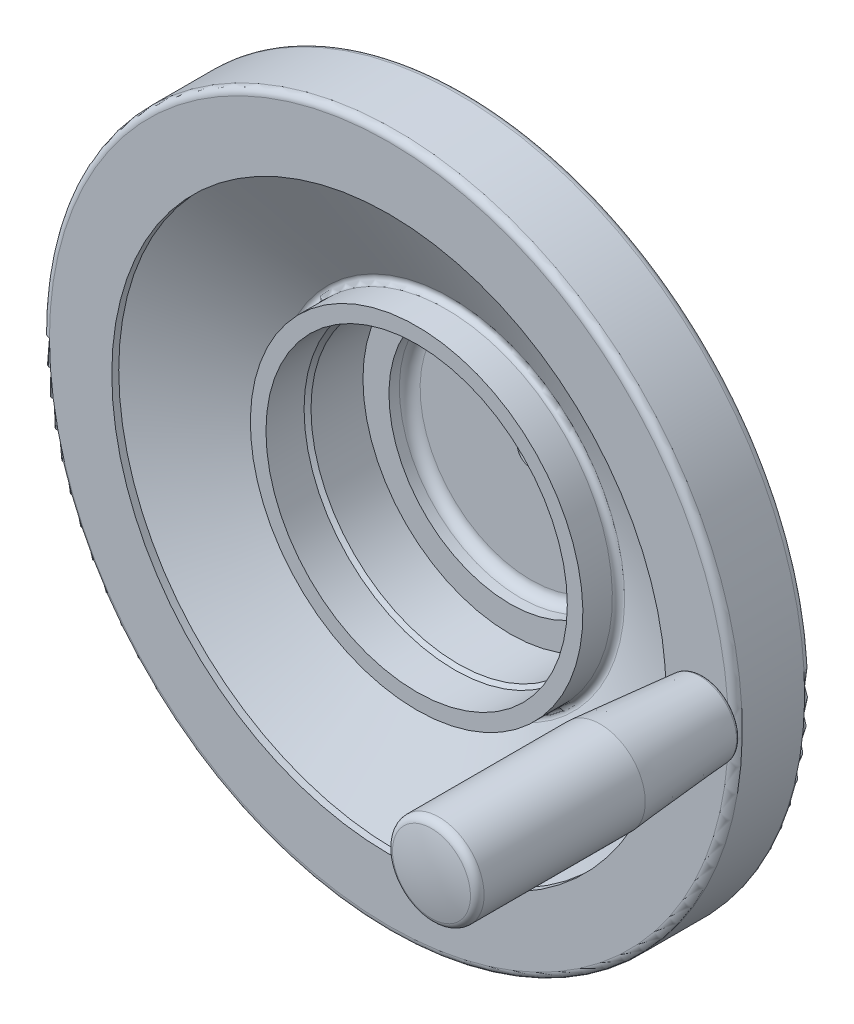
ISO-10303-21;
HEADER;
FILE_DESCRIPTION(('STEP AP214'),'2;1');
FILE_NAME('part.step','',(''),(''),'','','');
FILE_SCHEMA(('AUTOMOTIVE_DESIGN { 1 0 10303 214 1 1 1 1 }'));
ENDSEC;
DATA;
#1=APPLICATION_CONTEXT('core data for automotive mechanical design processes');
#2=APPLICATION_PROTOCOL_DEFINITION('international standard','automotive_design',2000,#1);
#3=PRODUCT_CONTEXT('',#1,'mechanical');
#4=PRODUCT('Part','Part','',(#3));
#5=PRODUCT_RELATED_PRODUCT_CATEGORY('part','',(#4));
#6=PRODUCT_DEFINITION_FORMATION('','',#4);
#7=PRODUCT_DEFINITION_CONTEXT('part definition',#1,'design');
#8=PRODUCT_DEFINITION('design','',#6,#7);
#9=PRODUCT_DEFINITION_SHAPE('','',#8);
#10=(LENGTH_UNIT() NAMED_UNIT(*) SI_UNIT(.MILLI.,.METRE.));
#11=(NAMED_UNIT(*) PLANE_ANGLE_UNIT() SI_UNIT($,.RADIAN.));
#12=(NAMED_UNIT(*) SI_UNIT($,.STERADIAN.) SOLID_ANGLE_UNIT());
#13=UNCERTAINTY_MEASURE_WITH_UNIT(LENGTH_MEASURE(1.E-05),#10,'distance_accuracy_value','');
#14=(GEOMETRIC_REPRESENTATION_CONTEXT(3) GLOBAL_UNCERTAINTY_ASSIGNED_CONTEXT((#13)) GLOBAL_UNIT_ASSIGNED_CONTEXT((#10,
#11,#12)) REPRESENTATION_CONTEXT('',''));
#15=CARTESIAN_POINT('',(0.,0.,0.));
#16=DIRECTION('',(0.,0.,1.));
#17=DIRECTION('',(1.,0.,0.));
#18=AXIS2_PLACEMENT_3D('',#15,#16,#17);
#19=CARTESIAN_POINT('',(-48.,0.,67.));
#20=DIRECTION('',(0.,0.,-1.));
#21=DIRECTION('',(0.,1.,0.));
#22=AXIS2_PLACEMENT_3D('',#19,#20,#21);
#23=PLANE('',#22);
#24=CARTESIAN_POINT('',(0.,0.,67.));
#25=DIRECTION('',(0.,0.,1.));
#26=DIRECTION('',(0.,-1.,0.));
#27=AXIS2_PLACEMENT_3D('',#24,#25,#26);
#28=CIRCLE('',#27,48.);
#29=CARTESIAN_POINT('',(0.,-48.,67.));
#30=VERTEX_POINT('',#29);
#31=EDGE_CURVE('E170',#30,#30,#28,.T.);
#32=ORIENTED_EDGE('',*,*,#31,.T.);
#33=EDGE_LOOP('',(#32));
#34=FACE_BOUND('',#33,.T.);
#35=CARTESIAN_POINT('',(0.,0.,67.));
#36=DIRECTION('',(0.,0.,-1.));
#37=DIRECTION('',(0.,1.,0.));
#38=AXIS2_PLACEMENT_3D('',#35,#36,#37);
#39=CIRCLE('',#38,43.5);
#40=CARTESIAN_POINT('',(0.,43.5,67.));
#41=VERTEX_POINT('',#40);
#42=EDGE_CURVE('E18',#41,#41,#39,.F.);
#43=ORIENTED_EDGE('',*,*,#42,.F.);
#44=EDGE_LOOP('',(#43));
#45=FACE_BOUND('',#44,.T.);
#46=ADVANCED_FACE('F14',(#34,#45),#23,.F.);
#47=CARTESIAN_POINT('',(0.,0.,30.));
#48=DIRECTION('',(0.,0.,-1.));
#49=DIRECTION('',(0.,1.,0.));
#50=AXIS2_PLACEMENT_3D('',#47,#48,#49);
#51=CYLINDRICAL_SURFACE('',#50,4.);
#52=CARTESIAN_POINT('',(0.,0.,0.));
#53=DIRECTION('',(0.,0.,-1.));
#54=DIRECTION('',(0.,1.,0.));
#55=AXIS2_PLACEMENT_3D('',#52,#53,#54);
#56=CIRCLE('',#55,4.);
#57=CARTESIAN_POINT('',(0.,4.,0.));
#58=VERTEX_POINT('',#57);
#59=EDGE_CURVE('E194',#58,#58,#56,.T.);
#60=ORIENTED_EDGE('',*,*,#59,.T.);
#61=EDGE_LOOP('',(#60));
#62=FACE_BOUND('',#61,.T.);
#63=CARTESIAN_POINT('',(0.,0.,34.));
#64=DIRECTION('',(0.,0.,1.));
#65=DIRECTION('',(0.,-1.,0.));
#66=AXIS2_PLACEMENT_3D('',#63,#64,#65);
#67=CIRCLE('',#66,4.);
#68=CARTESIAN_POINT('',(0.,-4.,34.));
#69=VERTEX_POINT('',#68);
#70=EDGE_CURVE('E53',#69,#69,#67,.F.);
#71=ORIENTED_EDGE('',*,*,#70,.F.);
#72=EDGE_LOOP('',(#71));
#73=FACE_BOUND('',#72,.T.);
#74=ADVANCED_FACE('F92',(#62,#73),#51,.F.);
#75=CARTESIAN_POINT('',(0.,0.,55.));
#76=DIRECTION('',(0.,0.,1.));
#77=DIRECTION('',(0.,-1.,0.));
#78=AXIS2_PLACEMENT_3D('',#75,#76,#77);
#79=TOROIDAL_SURFACE('',#78,98.,2.);
#80=CARTESIAN_POINT('',(0.,0.,53.));
#81=DIRECTION('',(0.,0.,1.));
#82=DIRECTION('',(0.,-1.,0.));
#83=AXIS2_PLACEMENT_3D('',#80,#81,#82);
#84=CIRCLE('',#83,98.);
#85=CARTESIAN_POINT('',(0.,-98.,53.));
#86=VERTEX_POINT('',#85);
#87=EDGE_CURVE('E22',#86,#86,#84,.T.);
#88=ORIENTED_EDGE('',*,*,#87,.T.);
#89=EDGE_LOOP('',(#88));
#90=FACE_BOUND('',#89,.T.);
#91=CARTESIAN_POINT('',(0.,0.,55.));
#92=DIRECTION('',(0.,0.,1.));
#93=DIRECTION('',(0.,-1.,0.));
#94=AXIS2_PLACEMENT_3D('',#91,#92,#93);
#95=CIRCLE('',#94,100.);
#96=CARTESIAN_POINT('',(0.,-100.,55.));
#97=VERTEX_POINT('',#96);
#98=EDGE_CURVE('E191',#97,#97,#95,.T.);
#99=ORIENTED_EDGE('',*,*,#98,.F.);
#100=EDGE_LOOP('',(#99));
#101=FACE_BOUND('',#100,.T.);
#102=ADVANCED_FACE('F16',(#90,#101),#79,.T.);
#103=CARTESIAN_POINT('',(-98.,0.,53.));
#104=DIRECTION('',(0.,0.,-1.));
#105=DIRECTION('',(0.,1.,0.));
#106=AXIS2_PLACEMENT_3D('',#103,#104,#105);
#107=PLANE('',#106);
#108=CARTESIAN_POINT('',(0.,0.,53.));
#109=DIRECTION('',(0.,0.,1.));
#110=DIRECTION('',(0.,-1.,0.));
#111=AXIS2_PLACEMENT_3D('',#108,#109,#110);
#112=CIRCLE('',#111,57.0227272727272);
#113=CARTESIAN_POINT('',(0.,-57.0227272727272,53.));
#114=VERTEX_POINT('',#113);
#115=EDGE_CURVE('E37',#114,#114,#112,.T.);
#116=ORIENTED_EDGE('',*,*,#115,.T.);
#117=EDGE_LOOP('',(#116));
#118=FACE_BOUND('',#117,.T.);
#119=ORIENTED_EDGE('',*,*,#87,.F.);
#120=EDGE_LOOP('',(#119));
#121=FACE_BOUND('',#120,.T.);
#122=ADVANCED_FACE('F475',(#118,#121),#107,.T.);
#123=CARTESIAN_POINT('',(0.,0.,53.));
#124=DIRECTION('',(0.,0.,1.));
#125=DIRECTION('',(0.,-1.,0.));
#126=AXIS2_PLACEMENT_3D('',#123,#124,#125);
#127=CONICAL_SURFACE('',#126,57.0227272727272,1.04023843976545);
#128=CARTESIAN_POINT('',(0.,0.,48.));
#129=DIRECTION('',(0.,0.,1.));
#130=DIRECTION('',(0.,-1.,0.));
#131=AXIS2_PLACEMENT_3D('',#128,#129,#130);
#132=CIRCLE('',#131,48.5);
#133=CARTESIAN_POINT('',(-48.5000000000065,0.,48.));
#134=VERTEX_POINT('',#133);
#135=EDGE_CURVE('E33',#134,#134,#132,.T.);
#136=ORIENTED_EDGE('',*,*,#135,.T.);
#137=EDGE_LOOP('',(#136));
#138=FACE_BOUND('',#137,.T.);
#139=ORIENTED_EDGE('',*,*,#115,.F.);
#140=EDGE_LOOP('',(#139));
#141=FACE_BOUND('',#140,.T.);
#142=ADVANCED_FACE('F35',(#138,#141),#127,.T.);
#143=CARTESIAN_POINT('',(0.,0.,48.));
#144=DIRECTION('',(0.,0.,1.));
#145=DIRECTION('',(0.,-1.,0.));
#146=AXIS2_PLACEMENT_3D('',#143,#144,#145);
#147=CONICAL_SURFACE('',#146,48.5,0.0554985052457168);
#148=CARTESIAN_POINT('',(-48.401160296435,2.15667976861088,47.085363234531));
#149=CARTESIAN_POINT('',(-48.3891722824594,2.27411950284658,46.9638971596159));
#150=CARTESIAN_POINT('',(-48.3766539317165,2.38133249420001,46.8324266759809));
#151=CARTESIAN_POINT('',(-48.3513507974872,2.57218652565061,46.5532267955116));
#152=CARTESIAN_POINT('',(-48.3385657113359,2.6557990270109,46.4054780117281));
#153=CARTESIAN_POINT('',(-48.3134952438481,2.79694732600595,46.098030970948));
#154=CARTESIAN_POINT('',(-48.3012096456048,2.8544945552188,45.9383379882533));
#155=CARTESIAN_POINT('',(-48.2777756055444,2.94188133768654,45.6115092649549));
#156=CARTESIAN_POINT('',(-48.2666268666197,2.97172814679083,45.4443754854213));
#157=CARTESIAN_POINT('',(-48.2459520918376,3.00283432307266,45.1075333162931));
#158=CARTESIAN_POINT('',(-48.2364244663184,3.00412185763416,44.9378276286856));
#159=CARTESIAN_POINT('',(-48.2192635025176,2.97809157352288,44.6005204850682));
#160=CARTESIAN_POINT('',(-48.2116302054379,2.95077313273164,44.432919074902));
#161=CARTESIAN_POINT('',(-48.198361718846,2.86841396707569,44.1052116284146));
#162=CARTESIAN_POINT('',(-48.1927196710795,2.8134700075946,43.9450815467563));
#163=CARTESIAN_POINT('',(-48.1832852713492,2.67744761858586,43.6362775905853));
#164=CARTESIAN_POINT('',(-48.1794928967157,2.59636950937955,43.4876035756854));
#165=CARTESIAN_POINT('',(-48.1734944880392,2.41054187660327,43.206214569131));
#166=CARTESIAN_POINT('',(-48.171285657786,2.30583450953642,43.0734717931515));
#167=CARTESIAN_POINT('',(-48.1680703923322,2.07563547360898,42.8274160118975));
#168=CARTESIAN_POINT('',(-48.1670639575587,1.95014379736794,42.7141030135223));
#169=CARTESIAN_POINT('',(-48.1658352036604,1.68188135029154,42.5100836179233));
#170=CARTESIAN_POINT('',(-48.1656131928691,1.53910380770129,42.4193861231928));
#171=CARTESIAN_POINT('',(-48.1655533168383,1.24035699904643,42.263227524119));
#172=CARTESIAN_POINT('',(-48.1657154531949,1.08438767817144,42.1977665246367));
#173=CARTESIAN_POINT('',(-48.1660983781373,0.763568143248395,42.0939010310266));
#174=CARTESIAN_POINT('',(-48.1663192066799,0.598711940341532,42.0555150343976));
#175=CARTESIAN_POINT('',(-48.1666140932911,0.264895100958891,42.0069616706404));
#176=CARTESIAN_POINT('',(-48.1666881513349,0.0959344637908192,41.9967943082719));
#177=CARTESIAN_POINT('',(-48.1666333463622,-0.241313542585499,42.0049672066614));
#178=CARTESIAN_POINT('',(-48.1665044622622,-0.409600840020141,42.0233104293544));
#179=CARTESIAN_POINT('',(-48.1661445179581,-0.740707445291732,42.0879893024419));
#180=CARTESIAN_POINT('',(-48.1659134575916,-0.903526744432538,42.1343249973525));
#181=CARTESIAN_POINT('',(-48.1655931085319,-1.21907660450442,42.2536740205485));
#182=CARTESIAN_POINT('',(-48.1655038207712,-1.37180709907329,42.3266875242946));
#183=CARTESIAN_POINT('',(-48.1658204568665,-1.66284224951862,42.4973194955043));
#184=CARTESIAN_POINT('',(-48.1662263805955,-1.80114690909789,42.5949379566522));
#185=CARTESIAN_POINT('',(-48.1679465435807,-2.0593840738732,42.8119911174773));
#186=CARTESIAN_POINT('',(-48.1692606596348,-2.17931906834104,42.9314228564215));
#187=CARTESIAN_POINT('',(-48.1732098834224,-2.39743071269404,43.1887109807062));
#188=CARTESIAN_POINT('',(-48.1758449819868,-2.49560751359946,43.3265672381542));
#189=CARTESIAN_POINT('',(-48.1827828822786,-2.66735410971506,43.6166653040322));
#190=CARTESIAN_POINT('',(-48.1870844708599,-2.74094173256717,43.7688965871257));
#191=CARTESIAN_POINT('',(-48.1975819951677,-2.8615339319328,44.0834846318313));
#192=CARTESIAN_POINT('',(-48.2037779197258,-2.90853866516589,44.2458413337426));
#193=CARTESIAN_POINT('',(-48.2181206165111,-2.97465349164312,44.5760033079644));
#194=CARTESIAN_POINT('',(-48.2262668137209,-2.99377179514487,44.7438069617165));
#195=CARTESIAN_POINT('',(-48.2443747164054,-3.00364499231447,45.0801479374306));
#196=CARTESIAN_POINT('',(-48.2543364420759,-2.9943995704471,45.2486852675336));
#197=CARTESIAN_POINT('',(-48.2757607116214,-2.94780925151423,45.5820700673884));
#198=CARTESIAN_POINT('',(-48.2872261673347,-2.91040915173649,45.7469096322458));
#199=CARTESIAN_POINT('',(-48.3111223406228,-2.8085389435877,46.0679271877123));
#200=CARTESIAN_POINT('',(-48.3235530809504,-2.7440681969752,46.2241049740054));
#201=CARTESIAN_POINT('',(-48.3487580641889,-2.58961546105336,46.5239523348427));
#202=CARTESIAN_POINT('',(-48.361533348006,-2.49954585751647,46.667576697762));
#203=CARTESIAN_POINT('',(-48.3866207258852,-2.29651749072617,46.9376662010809));
#204=CARTESIAN_POINT('',(-48.3989328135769,-2.18355841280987,47.0641311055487));
#205=CARTESIAN_POINT('',(-48.4223114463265,-1.93778605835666,47.2964330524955));
#206=CARTESIAN_POINT('',(-48.4333767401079,-1.80495314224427,47.4022494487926));
#207=CARTESIAN_POINT('',(-48.453492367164,-1.5232522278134,47.5900495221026));
#208=CARTESIAN_POINT('',(-48.462542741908,-1.37438455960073,47.6720336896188));
#209=CARTESIAN_POINT('',(-48.4779545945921,-1.06545984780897,47.8094952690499));
#210=CARTESIAN_POINT('',(-48.4843266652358,-0.905449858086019,47.865077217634));
#211=CARTESIAN_POINT('',(-48.4939709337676,-0.578284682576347,47.948573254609));
#212=CARTESIAN_POINT('',(-48.4972433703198,-0.411130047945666,47.9764894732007));
#213=CARTESIAN_POINT('',(-48.5004379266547,-0.075487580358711,48.0037449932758));
#214=CARTESIAN_POINT('',(-48.5003800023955,0.0929862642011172,48.0032545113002));
#215=CARTESIAN_POINT('',(-48.4969670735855,0.427491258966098,47.9741281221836));
#216=CARTESIAN_POINT('',(-48.4936113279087,0.593521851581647,47.9454858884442));
#217=CARTESIAN_POINT('',(-48.4838546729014,0.918150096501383,47.8609629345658));
#218=CARTESIAN_POINT('',(-48.4774577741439,1.07675723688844,47.8051180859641));
#219=CARTESIAN_POINT('',(-48.4620813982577,1.3822047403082,47.6678615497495));
#220=CARTESIAN_POINT('',(-48.4531048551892,1.52905823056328,47.5864788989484));
#221=CARTESIAN_POINT('',(-48.436824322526,1.75642211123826,47.434405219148));
#222=CARTESIAN_POINT('',(-48.4300979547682,1.84164826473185,47.3705761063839));
#223=CARTESIAN_POINT('',(-48.4160378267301,2.00482610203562,47.234272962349));
#224=CARTESIAN_POINT('',(-48.408704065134,2.08277777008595,47.1617989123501));
#225=CARTESIAN_POINT('',(-48.401160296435,2.15667976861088,47.085363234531));
#226=B_SPLINE_CURVE_WITH_KNOTS('',3,(#148,#149,#150,#151,#152,#153,#154,#155,#156,#157,#158,
#159,#160,#161,#162,#163,#164,#165,#166,#167,#168,#169,#170,#171,#172,#173,#174,#175,#176,#177,
#178,#179,#180,#181,#182,#183,#184,#185,#186,#187,#188,#189,#190,#191,#192,#193,#194,#195,#196,
#197,#198,#199,#200,#201,#202,#203,#204,#205,#206,#207,#208,#209,#210,#211,#212,#213,#214,#215,
#216,#217,#218,#219,#220,#221,#222,#223,#224,#225),.UNSPECIFIED.,.T.,.F.,(4,2,2,2,2,2,2,2,2,2,2,
2,2,2,2,2,2,2,2,2,2,2,2,2,2,2,2,2,2,2,2,2,2,2,2,2,2,2,4),(0.,0.507753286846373,1.01611796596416,
1.52425947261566,2.03226783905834,2.53977514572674,3.04729348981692,3.55304637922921,
4.05879306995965,4.56364450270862,5.06849611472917,5.57354614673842,6.07859827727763,
6.5839951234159,7.08939205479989,7.59484149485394,8.10029173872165,8.60574530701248,
9.11119874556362,9.61658362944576,10.1219650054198,10.6269791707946,11.1319903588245,
11.6368528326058,12.1417209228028,12.6475814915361,13.1534539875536,13.6610791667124,
14.1687113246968,14.6768484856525,15.1849751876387,15.691072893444,16.1971316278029,
16.7001583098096,17.2032980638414,17.7057761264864,18.2076849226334,18.5272011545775,
18.8467180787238),.UNSPECIFIED.);
#227=EDGE_CURVE('E9',#134,#134,#226,.T.);
#228=ORIENTED_EDGE('',*,*,#227,.F.);
#229=ORIENTED_EDGE('',*,*,#135,.F.);
#230=EDGE_LOOP('',(#228,#229));
#231=FACE_BOUND('',#230,.T.);
#232=CARTESIAN_POINT('',(0.,0.,30.));
#233=DIRECTION('',(0.,0.,1.));
#234=DIRECTION('',(0.,-1.,0.));
#235=AXIS2_PLACEMENT_3D('',#232,#233,#234);
#236=CIRCLE('',#235,47.5);
#237=CARTESIAN_POINT('',(0.,-47.5,30.));
#238=VERTEX_POINT('',#237);
#239=EDGE_CURVE('E38',#238,#238,#236,.T.);
#240=ORIENTED_EDGE('',*,*,#239,.T.);
#241=EDGE_LOOP('',(#240));
#242=FACE_BOUND('',#241,.T.);
#243=ADVANCED_FACE('F31',(#231,#242),#147,.T.);
#244=CARTESIAN_POINT('',(0.,0.,25.));
#245=DIRECTION('',(0.,0.,1.));
#246=DIRECTION('',(0.,-1.,0.));
#247=AXIS2_PLACEMENT_3D('',#244,#245,#246);
#248=CONICAL_SURFACE('',#247,41.5,0.876058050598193);
#249=ORIENTED_EDGE('',*,*,#239,.F.);
#250=EDGE_LOOP('',(#249));
#251=FACE_BOUND('',#250,.T.);
#252=CARTESIAN_POINT('',(0.,0.,25.));
#253=DIRECTION('',(0.,0.,1.));
#254=DIRECTION('',(0.,-1.,0.));
#255=AXIS2_PLACEMENT_3D('',#252,#253,#254);
#256=CIRCLE('',#255,41.5);
#257=CARTESIAN_POINT('',(0.,-41.5,25.));
#258=VERTEX_POINT('',#257);
#259=EDGE_CURVE('E43',#258,#258,#256,.T.);
#260=ORIENTED_EDGE('',*,*,#259,.T.);
#261=EDGE_LOOP('',(#260));
#262=FACE_BOUND('',#261,.T.);
#263=ADVANCED_FACE('F144',(#251,#262),#248,.T.);
#264=CARTESIAN_POINT('',(-27.2136434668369,0.,25.));
#265=DIRECTION('',(0.,0.,1.));
#266=DIRECTION('',(0.,-1.,0.));
#267=AXIS2_PLACEMENT_3D('',#264,#265,#266);
#268=PLANE('',#267);
#269=ORIENTED_EDGE('',*,*,#259,.F.);
#270=EDGE_LOOP('',(#269));
#271=FACE_BOUND('',#270,.T.);
#272=CARTESIAN_POINT('',(0.,0.,25.));
#273=DIRECTION('',(0.,0.,1.));
#274=DIRECTION('',(0.,-1.,0.));
#275=AXIS2_PLACEMENT_3D('',#272,#273,#274);
#276=CIRCLE('',#275,27.2136434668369);
#277=CARTESIAN_POINT('',(0.,-27.2136434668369,25.));
#278=VERTEX_POINT('',#277);
#279=EDGE_CURVE('E157',#278,#278,#276,.T.);
#280=ORIENTED_EDGE('',*,*,#279,.T.);
#281=EDGE_LOOP('',(#280));
#282=FACE_BOUND('',#281,.T.);
#283=ADVANCED_FACE('F141',(#271,#282),#268,.F.);
#284=CARTESIAN_POINT('',(0.,0.,22.501320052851));
#285=DIRECTION('',(0.,0.,1.));
#286=DIRECTION('',(0.,-1.,0.));
#287=AXIS2_PLACEMENT_3D('',#284,#285,#286);
#288=TOROIDAL_SURFACE('',#287,27.1324121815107,2.5);
#289=ORIENTED_EDGE('',*,*,#279,.F.);
#290=EDGE_LOOP('',(#289));
#291=FACE_BOUND('',#290,.T.);
#292=CARTESIAN_POINT('',(0.,0.,21.802635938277));
#293=DIRECTION('',(0.,0.,1.));
#294=DIRECTION('',(0.,-1.,0.));
#295=AXIS2_PLACEMENT_3D('',#292,#293,#294);
#296=CIRCLE('',#295,24.7320287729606);
#297=CARTESIAN_POINT('',(0.,-24.7320287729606,21.802635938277));
#298=VERTEX_POINT('',#297);
#299=EDGE_CURVE('E159',#298,#298,#296,.T.);
#300=ORIENTED_EDGE('',*,*,#299,.T.);
#301=EDGE_LOOP('',(#300));
#302=FACE_BOUND('',#301,.T.);
#303=ADVANCED_FACE('F137',(#291,#302),#288,.F.);
#304=CARTESIAN_POINT('',(0.,0.,3.50000000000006));
#305=DIRECTION('',(0.,0.,1.));
#306=DIRECTION('',(0.,-1.,0.));
#307=AXIS2_PLACEMENT_3D('',#304,#305,#306);
#308=CONICAL_SURFACE('',#307,22.5,0.121352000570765);
#309=ORIENTED_EDGE('',*,*,#299,.F.);
#310=EDGE_LOOP('',(#309));
#311=FACE_BOUND('',#310,.T.);
#312=CARTESIAN_POINT('',(0.,0.,3.50000000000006));
#313=DIRECTION('',(0.,0.,1.));
#314=DIRECTION('',(0.,-1.,0.));
#315=AXIS2_PLACEMENT_3D('',#312,#313,#314);
#316=CIRCLE('',#315,22.5);
#317=CARTESIAN_POINT('',(0.,-22.5,3.50000000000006));
#318=VERTEX_POINT('',#317);
#319=EDGE_CURVE('E164',#318,#318,#316,.T.);
#320=ORIENTED_EDGE('',*,*,#319,.T.);
#321=EDGE_LOOP('',(#320));
#322=FACE_BOUND('',#321,.T.);
#323=ADVANCED_FACE('F133',(#311,#322),#308,.T.);
#324=CARTESIAN_POINT('',(0.,0.,0.));
#325=DIRECTION('',(0.,0.,1.));
#326=DIRECTION('',(0.,-1.,0.));
#327=AXIS2_PLACEMENT_3D('',#324,#325,#326);
#328=CONICAL_SURFACE('',#327,19.5,0.708626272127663);
#329=ORIENTED_EDGE('',*,*,#319,.F.);
#330=EDGE_LOOP('',(#329));
#331=FACE_BOUND('',#330,.T.);
#332=CARTESIAN_POINT('',(0.,0.,0.));
#333=DIRECTION('',(0.,0.,1.));
#334=DIRECTION('',(0.,-1.,0.));
#335=AXIS2_PLACEMENT_3D('',#332,#333,#334);
#336=CIRCLE('',#335,19.5);
#337=CARTESIAN_POINT('',(0.,-19.5,0.));
#338=VERTEX_POINT('',#337);
#339=EDGE_CURVE('E167',#338,#338,#336,.T.);
#340=ORIENTED_EDGE('',*,*,#339,.T.);
#341=EDGE_LOOP('',(#340));
#342=FACE_BOUND('',#341,.T.);
#343=ADVANCED_FACE('F129',(#331,#342),#328,.T.);
#344=CARTESIAN_POINT('',(0.,0.,0.));
#345=DIRECTION('',(0.,0.,1.));
#346=DIRECTION('',(0.,-1.,0.));
#347=AXIS2_PLACEMENT_3D('',#344,#345,#346);
#348=PLANE('',#347);
#349=ORIENTED_EDGE('',*,*,#59,.F.);
#350=EDGE_LOOP('',(#349));
#351=FACE_BOUND('',#350,.T.);
#352=ORIENTED_EDGE('',*,*,#339,.F.);
#353=EDGE_LOOP('',(#352));
#354=FACE_BOUND('',#353,.T.);
#355=ADVANCED_FACE('F122',(#351,#354),#348,.F.);
#356=CARTESIAN_POINT('',(0.,0.,113.818267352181));
#357=DIRECTION('',(0.,0.,1.));
#358=DIRECTION('',(0.,-1.,0.));
#359=AXIS2_PLACEMENT_3D('',#356,#357,#358);
#360=CYLINDRICAL_SURFACE('',#359,48.);
#361=ORIENTED_EDGE('',*,*,#31,.F.);
#362=EDGE_LOOP('',(#361));
#363=FACE_BOUND('',#362,.T.);
#364=CARTESIAN_POINT('',(0.,0.,58.4954066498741));
#365=DIRECTION('',(0.,0.,1.));
#366=DIRECTION('',(0.,-1.,0.));
#367=AXIS2_PLACEMENT_3D('',#364,#365,#366);
#368=CIRCLE('',#367,48.);
#369=CARTESIAN_POINT('',(0.,-48.,58.4954066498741));
#370=VERTEX_POINT('',#369);
#371=EDGE_CURVE('E173',#370,#370,#368,.T.);
#372=ORIENTED_EDGE('',*,*,#371,.T.);
#373=EDGE_LOOP('',(#372));
#374=FACE_BOUND('',#373,.T.);
#375=ADVANCED_FACE('F118',(#363,#374),#360,.T.);
#376=CARTESIAN_POINT('',(0.,0.,58.4954066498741));
#377=DIRECTION('',(0.,0.,1.));
#378=DIRECTION('',(0.,-1.,0.));
#379=AXIS2_PLACEMENT_3D('',#376,#377,#378);
#380=TOROIDAL_SURFACE('',#379,49.5,1.49999999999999);
#381=ORIENTED_EDGE('',*,*,#371,.F.);
#382=EDGE_LOOP('',(#381));
#383=FACE_BOUND('',#382,.T.);
#384=CARTESIAN_POINT('',(0.,0.,57.170733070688));
#385=DIRECTION('',(0.,0.,1.));
#386=DIRECTION('',(0.,-1.,0.));
#387=AXIS2_PLACEMENT_3D('',#384,#385,#386);
#388=CIRCLE('',#387,50.2037328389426);
#389=CARTESIAN_POINT('',(0.,-50.2037328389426,57.170733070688));
#390=VERTEX_POINT('',#389);
#391=EDGE_CURVE('E176',#390,#390,#388,.T.);
#392=ORIENTED_EDGE('',*,*,#391,.T.);
#393=EDGE_LOOP('',(#392));
#394=FACE_BOUND('',#393,.T.);
#395=ADVANCED_FACE('F114',(#383,#394),#380,.F.);
#396=CARTESIAN_POINT('',(0.,0.,57.170733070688));
#397=DIRECTION('',(0.,0.,1.));
#398=DIRECTION('',(0.,-1.,0.));
#399=AXIS2_PLACEMENT_3D('',#396,#397,#398);
#400=CONICAL_SURFACE('',#399,50.2037328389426,1.08246237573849);
#401=CARTESIAN_POINT('',(0.,0.,73.));
#402=DIRECTION('',(0.,0.,1.));
#403=DIRECTION('',(0.,-1.,0.));
#404=AXIS2_PLACEMENT_3D('',#401,#402,#403);
#405=CIRCLE('',#404,80.);
#406=CARTESIAN_POINT('',(0.,-80.,73.));
#407=VERTEX_POINT('',#406);
#408=EDGE_CURVE('E179',#407,#407,#405,.T.);
#409=ORIENTED_EDGE('',*,*,#408,.T.);
#410=EDGE_LOOP('',(#409));
#411=FACE_BOUND('',#410,.T.);
#412=ORIENTED_EDGE('',*,*,#391,.F.);
#413=EDGE_LOOP('',(#412));
#414=FACE_BOUND('',#413,.T.);
#415=ADVANCED_FACE('F110',(#411,#414),#400,.F.);
#416=CARTESIAN_POINT('',(0.,0.,113.818267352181));
#417=DIRECTION('',(0.,0.,1.));
#418=DIRECTION('',(0.,-1.,0.));
#419=AXIS2_PLACEMENT_3D('',#416,#417,#418);
#420=CYLINDRICAL_SURFACE('',#419,80.);
#421=ORIENTED_EDGE('',*,*,#408,.F.);
#422=EDGE_LOOP('',(#421));
#423=FACE_BOUND('',#422,.T.);
#424=CARTESIAN_POINT('',(0.,0.,75.));
#425=DIRECTION('',(0.,0.,1.));
#426=DIRECTION('',(0.,-1.,0.));
#427=AXIS2_PLACEMENT_3D('',#424,#425,#426);
#428=CIRCLE('',#427,80.);
#429=CARTESIAN_POINT('',(0.,-80.,75.));
#430=VERTEX_POINT('',#429);
#431=EDGE_CURVE('E182',#430,#430,#428,.T.);
#432=ORIENTED_EDGE('',*,*,#431,.T.);
#433=EDGE_LOOP('',(#432));
#434=FACE_BOUND('',#433,.T.);
#435=ADVANCED_FACE('F106',(#423,#434),#420,.F.);
#436=CARTESIAN_POINT('',(-98.,0.,75.));
#437=DIRECTION('',(0.,0.,-1.));
#438=DIRECTION('',(0.,1.,0.));
#439=AXIS2_PLACEMENT_3D('',#436,#437,#438);
#440=PLANE('',#439);
#441=CARTESIAN_POINT('',(91.,0.,75.));
#442=DIRECTION('',(0.,0.,1.));
#443=DIRECTION('',(0.,-1.,0.));
#444=AXIS2_PLACEMENT_3D('',#441,#442,#443);
#445=CIRCLE('',#444,6.00063861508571);
#446=CARTESIAN_POINT('',(91.,-6.00063861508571,75.));
#447=VERTEX_POINT('',#446);
#448=EDGE_CURVE('E215',#447,#447,#445,.T.);
#449=ORIENTED_EDGE('',*,*,#448,.F.);
#450=EDGE_LOOP('',(#449));
#451=FACE_BOUND('',#450,.T.);
#452=ORIENTED_EDGE('',*,*,#431,.F.);
#453=EDGE_LOOP('',(#452));
#454=FACE_BOUND('',#453,.T.);
#455=CARTESIAN_POINT('',(0.,0.,75.));
#456=DIRECTION('',(0.,0.,1.));
#457=DIRECTION('',(0.,-1.,0.));
#458=AXIS2_PLACEMENT_3D('',#455,#456,#457);
#459=CIRCLE('',#458,98.);
#460=CARTESIAN_POINT('',(0.,-98.,75.));
#461=VERTEX_POINT('',#460);
#462=EDGE_CURVE('E185',#461,#461,#459,.T.);
#463=ORIENTED_EDGE('',*,*,#462,.T.);
#464=EDGE_LOOP('',(#463));
#465=FACE_BOUND('',#464,.T.);
#466=ADVANCED_FACE('F102',(#451,#454,#465),#440,.F.);
#467=CARTESIAN_POINT('',(0.,0.,73.));
#468=DIRECTION('',(0.,0.,1.));
#469=DIRECTION('',(0.,-1.,0.));
#470=AXIS2_PLACEMENT_3D('',#467,#468,#469);
#471=TOROIDAL_SURFACE('',#470,98.,2.);
#472=CARTESIAN_POINT('',(0.,0.,73.));
#473=DIRECTION('',(0.,0.,1.));
#474=DIRECTION('',(0.,-1.,0.));
#475=AXIS2_PLACEMENT_3D('',#472,#473,#474);
#476=CIRCLE('',#475,100.);
#477=CARTESIAN_POINT('',(0.,-100.,73.));
#478=VERTEX_POINT('',#477);
#479=EDGE_CURVE('E188',#478,#478,#476,.T.);
#480=ORIENTED_EDGE('',*,*,#479,.T.);
#481=EDGE_LOOP('',(#480));
#482=FACE_BOUND('',#481,.T.);
#483=ORIENTED_EDGE('',*,*,#462,.F.);
#484=EDGE_LOOP('',(#483));
#485=FACE_BOUND('',#484,.T.);
#486=ADVANCED_FACE('F98',(#482,#485),#471,.T.);
#487=CARTESIAN_POINT('',(0.,0.,113.818267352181));
#488=DIRECTION('',(0.,0.,1.));
#489=DIRECTION('',(0.,-1.,0.));
#490=AXIS2_PLACEMENT_3D('',#487,#488,#489);
#491=CYLINDRICAL_SURFACE('',#490,100.);
#492=ORIENTED_EDGE('',*,*,#479,.F.);
#493=EDGE_LOOP('',(#492));
#494=FACE_BOUND('',#493,.T.);
#495=ORIENTED_EDGE('',*,*,#98,.T.);
#496=EDGE_LOOP('',(#495));
#497=FACE_BOUND('',#496,.T.);
#498=ADVANCED_FACE('F90',(#494,#497),#491,.T.);
#499=CARTESIAN_POINT('',(91.,0.,105.));
#500=DIRECTION('',(0.,-1.,0.));
#501=DIRECTION('',(0.,0.,-1.));
#502=AXIS2_PLACEMENT_3D('',#499,#500,#501);
#503=SPHERICAL_SURFACE('',#502,50.);
#504=CARTESIAN_POINT('',(91.,0.,105.));
#505=DIRECTION('',(0.,0.,1.));
#506=DIRECTION('',(0.,-1.,0.));
#507=AXIS2_PLACEMENT_3D('',#504,#505,#506);
#508=SPHERICAL_SURFACE('',#507,50.);
#509=CARTESIAN_POINT('',(91.,0.,153.716426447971));
#510=DIRECTION('',(0.,0.,1.));
#511=DIRECTION('',(0.,-1.,0.));
#512=AXIS2_PLACEMENT_3D('',#509,#510,#511);
#513=CIRCLE('',#512,11.2565445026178);
#514=CARTESIAN_POINT('',(91.,-11.2565445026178,153.716426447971));
#515=VERTEX_POINT('',#514);
#516=EDGE_CURVE('E197',#515,#515,#513,.T.);
#517=ORIENTED_EDGE('',*,*,#516,.T.);
#518=EDGE_LOOP('',(#517));
#519=FACE_BOUND('',#518,.T.);
#520=ADVANCED_FACE('F86',(#519),#508,.T.);
#521=CARTESIAN_POINT('',(91.,0.,151.524187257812));
#522=DIRECTION('',(0.,0.,1.));
#523=DIRECTION('',(0.,-1.,0.));
#524=AXIS2_PLACEMENT_3D('',#521,#522,#523);
#525=TOROIDAL_SURFACE('',#524,10.75,2.25);
#526=CARTESIAN_POINT('',(91.,0.,151.524187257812));
#527=DIRECTION('',(0.,0.,1.));
#528=DIRECTION('',(0.,-1.,0.));
#529=AXIS2_PLACEMENT_3D('',#526,#527,#528);
#530=CIRCLE('',#529,13.);
#531=CARTESIAN_POINT('',(91.,-13.,151.524187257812));
#532=VERTEX_POINT('',#531);
#533=EDGE_CURVE('E200',#532,#532,#530,.T.);
#534=ORIENTED_EDGE('',*,*,#533,.T.);
#535=EDGE_LOOP('',(#534));
#536=FACE_BOUND('',#535,.T.);
#537=ORIENTED_EDGE('',*,*,#516,.F.);
#538=EDGE_LOOP('',(#537));
#539=FACE_BOUND('',#538,.T.);
#540=ADVANCED_FACE('F82',(#536,#539),#525,.T.);
#541=CARTESIAN_POINT('',(91.,0.,180.594006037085));
#542=DIRECTION('',(0.,0.,1.));
#543=DIRECTION('',(0.,-1.,0.));
#544=AXIS2_PLACEMENT_3D('',#541,#542,#543);
#545=CYLINDRICAL_SURFACE('',#544,13.);
#546=CARTESIAN_POINT('',(91.,0.,105.));
#547=DIRECTION('',(0.,0.,1.));
#548=DIRECTION('',(0.,-1.,0.));
#549=AXIS2_PLACEMENT_3D('',#546,#547,#548);
#550=CIRCLE('',#549,13.);
#551=CARTESIAN_POINT('',(91.,-13.,105.));
#552=VERTEX_POINT('',#551);
#553=EDGE_CURVE('E203',#552,#552,#550,.T.);
#554=ORIENTED_EDGE('',*,*,#553,.T.);
#555=EDGE_LOOP('',(#554));
#556=FACE_BOUND('',#555,.T.);
#557=ORIENTED_EDGE('',*,*,#533,.F.);
#558=EDGE_LOOP('',(#557));
#559=FACE_BOUND('',#558,.T.);
#560=ADVANCED_FACE('F78',(#556,#559),#545,.T.);
#561=CARTESIAN_POINT('',(91.,0.,76.216118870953));
#562=DIRECTION('',(0.,0.,1.));
#563=DIRECTION('',(0.,-1.,0.));
#564=AXIS2_PLACEMENT_3D('',#561,#562,#563);
#565=CONICAL_SURFACE('',#564,10.577114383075,0.0839771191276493);
#566=ORIENTED_EDGE('',*,*,#553,.F.);
#567=EDGE_LOOP('',(#566));
#568=FACE_BOUND('',#567,.T.);
#569=CARTESIAN_POINT('',(91.,0.,76.216118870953));
#570=DIRECTION('',(0.,0.,1.));
#571=DIRECTION('',(0.,-1.,0.));
#572=AXIS2_PLACEMENT_3D('',#569,#570,#571);
#573=CIRCLE('',#572,10.577114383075);
#574=CARTESIAN_POINT('',(91.,-10.577114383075,76.216118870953));
#575=VERTEX_POINT('',#574);
#576=EDGE_CURVE('E206',#575,#575,#573,.T.);
#577=ORIENTED_EDGE('',*,*,#576,.T.);
#578=EDGE_LOOP('',(#577));
#579=FACE_BOUND('',#578,.T.);
#580=ADVANCED_FACE('F74',(#568,#579),#565,.T.);
#581=CARTESIAN_POINT('',(91.,0.,76.3));
#582=DIRECTION('',(0.,0.,1.));
#583=DIRECTION('',(0.,-1.,0.));
#584=AXIS2_PLACEMENT_3D('',#581,#582,#583);
#585=TOROIDAL_SURFACE('',#584,9.58063861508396,1.00000000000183);
#586=CARTESIAN_POINT('',(91.,0.,75.3));
#587=DIRECTION('',(0.,0.,1.));
#588=DIRECTION('',(0.,-1.,0.));
#589=AXIS2_PLACEMENT_3D('',#586,#587,#588);
#590=CIRCLE('',#589,9.58063861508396);
#591=CARTESIAN_POINT('',(91.,-9.58063861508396,75.3));
#592=VERTEX_POINT('',#591);
#593=EDGE_CURVE('E209',#592,#592,#590,.T.);
#594=ORIENTED_EDGE('',*,*,#593,.T.);
#595=EDGE_LOOP('',(#594));
#596=FACE_BOUND('',#595,.T.);
#597=ORIENTED_EDGE('',*,*,#576,.F.);
#598=EDGE_LOOP('',(#597));
#599=FACE_BOUND('',#598,.T.);
#600=ADVANCED_FACE('F70',(#596,#599),#585,.T.);
#601=CARTESIAN_POINT('',(84.9993613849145,0.,75.3));
#602=DIRECTION('',(0.,0.,1.));
#603=DIRECTION('',(0.,-1.,0.));
#604=AXIS2_PLACEMENT_3D('',#601,#602,#603);
#605=PLANE('',#604);
#606=ORIENTED_EDGE('',*,*,#593,.F.);
#607=EDGE_LOOP('',(#606));
#608=FACE_BOUND('',#607,.T.);
#609=CARTESIAN_POINT('',(91.,0.,75.3));
#610=DIRECTION('',(0.,0.,1.));
#611=DIRECTION('',(0.,-1.,0.));
#612=AXIS2_PLACEMENT_3D('',#609,#610,#611);
#613=CIRCLE('',#612,6.00063861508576);
#614=CARTESIAN_POINT('',(91.,-6.00063861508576,75.3));
#615=VERTEX_POINT('',#614);
#616=EDGE_CURVE('E212',#615,#615,#613,.T.);
#617=ORIENTED_EDGE('',*,*,#616,.T.);
#618=EDGE_LOOP('',(#617));
#619=FACE_BOUND('',#618,.T.);
#620=ADVANCED_FACE('F66',(#608,#619),#605,.F.);
#621=CARTESIAN_POINT('',(91.,0.,180.594006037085));
#622=DIRECTION('',(0.,0.,1.));
#623=DIRECTION('',(0.,-1.,0.));
#624=AXIS2_PLACEMENT_3D('',#621,#622,#623);
#625=CYLINDRICAL_SURFACE('',#624,6.00063861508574);
#626=ORIENTED_EDGE('',*,*,#448,.T.);
#627=EDGE_LOOP('',(#626));
#628=FACE_BOUND('',#627,.T.);
#629=ORIENTED_EDGE('',*,*,#616,.F.);
#630=EDGE_LOOP('',(#629));
#631=FACE_BOUND('',#630,.T.);
#632=ADVANCED_FACE('F62',(#628,#631),#625,.T.);
#633=CARTESIAN_POINT('',(-43.9568905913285,0.,45.));
#634=DIRECTION('',(1.,0.,0.));
#635=DIRECTION('',(0.,-1.,0.));
#636=AXIS2_PLACEMENT_3D('',#633,#634,#635);
#637=CYLINDRICAL_SURFACE('',#636,3.);
#638=ORIENTED_EDGE('',*,*,#227,.T.);
#639=EDGE_LOOP('',(#638));
#640=FACE_BOUND('',#639,.T.);
#641=CARTESIAN_POINT('',(-45.333333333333,0.,45.));
#642=DIRECTION('',(1.,0.,0.));
#643=DIRECTION('',(0.,-1.,0.));
#644=AXIS2_PLACEMENT_3D('',#641,#642,#643);
#645=CIRCLE('',#644,3.);
#646=CARTESIAN_POINT('',(-45.333333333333,-3.,45.));
#647=VERTEX_POINT('',#646);
#648=EDGE_CURVE('E218',#647,#647,#645,.T.);
#649=ORIENTED_EDGE('',*,*,#648,.T.);
#650=EDGE_LOOP('',(#649));
#651=FACE_BOUND('',#650,.T.);
#652=ADVANCED_FACE('F26',(#640,#651),#637,.F.);
#653=CARTESIAN_POINT('',(-45.333333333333,0.,48.));
#654=DIRECTION('',(-1.,0.,0.));
#655=DIRECTION('',(0.,1.,0.));
#656=AXIS2_PLACEMENT_3D('',#653,#654,#655);
#657=PLANE('',#656);
#658=ORIENTED_EDGE('',*,*,#648,.F.);
#659=EDGE_LOOP('',(#658));
#660=FACE_BOUND('',#659,.T.);
#661=ADVANCED_FACE('F61',(#660),#657,.T.);
#662=CARTESIAN_POINT('',(0.,0.,136.180311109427));
#663=DIRECTION('',(0.,0.,1.));
#664=DIRECTION('',(0.,-1.,0.));
#665=AXIS2_PLACEMENT_3D('',#662,#663,#664);
#666=CYLINDRICAL_SURFACE('',#665,43.5);
#667=CARTESIAN_POINT('',(0.,0.,56.));
#668=DIRECTION('',(0.,0.,1.));
#669=DIRECTION('',(0.,-1.,0.));
#670=AXIS2_PLACEMENT_3D('',#667,#668,#669);
#671=CIRCLE('',#670,43.5);
#672=CARTESIAN_POINT('',(0.,-43.5,56.));
#673=VERTEX_POINT('',#672);
#674=EDGE_CURVE('E236',#673,#673,#671,.T.);
#675=ORIENTED_EDGE('',*,*,#674,.F.);
#676=EDGE_LOOP('',(#675));
#677=FACE_BOUND('',#676,.T.);
#678=ORIENTED_EDGE('',*,*,#42,.T.);
#679=EDGE_LOOP('',(#678));
#680=FACE_BOUND('',#679,.T.);
#681=ADVANCED_FACE('F243',(#677,#680),#666,.F.);
#682=CARTESIAN_POINT('',(0.,32.,34.));
#683=DIRECTION('',(0.,0.,1.));
#684=DIRECTION('',(0.,-1.,0.));
#685=AXIS2_PLACEMENT_3D('',#682,#683,#684);
#686=PLANE('',#685);
#687=CARTESIAN_POINT('',(0.,0.,34.));
#688=DIRECTION('',(0.,0.,1.));
#689=DIRECTION('',(0.,-1.,0.));
#690=AXIS2_PLACEMENT_3D('',#687,#688,#689);
#691=CIRCLE('',#690,32.);
#692=CARTESIAN_POINT('',(0.,-32.,34.));
#693=VERTEX_POINT('',#692);
#694=EDGE_CURVE('E221',#693,#693,#691,.T.);
#695=ORIENTED_EDGE('',*,*,#694,.T.);
#696=EDGE_LOOP('',(#695));
#697=FACE_BOUND('',#696,.T.);
#698=ORIENTED_EDGE('',*,*,#70,.T.);
#699=EDGE_LOOP('',(#698));
#700=FACE_BOUND('',#699,.T.);
#701=ADVANCED_FACE('F246',(#697,#700),#686,.T.);
#702=CARTESIAN_POINT('',(0.,0.,37.));
#703=DIRECTION('',(0.,0.,1.));
#704=DIRECTION('',(0.,-1.,0.));
#705=AXIS2_PLACEMENT_3D('',#702,#703,#704);
#706=TOROIDAL_SURFACE('',#705,32.,3.);
#707=CARTESIAN_POINT('',(0.,0.,37.));
#708=DIRECTION('',(0.,0.,1.));
#709=DIRECTION('',(0.,-1.,0.));
#710=AXIS2_PLACEMENT_3D('',#707,#708,#709);
#711=CIRCLE('',#710,35.);
#712=CARTESIAN_POINT('',(0.,-35.,37.));
#713=VERTEX_POINT('',#712);
#714=EDGE_CURVE('E224',#713,#713,#711,.T.);
#715=ORIENTED_EDGE('',*,*,#714,.T.);
#716=EDGE_LOOP('',(#715));
#717=FACE_BOUND('',#716,.T.);
#718=ORIENTED_EDGE('',*,*,#694,.F.);
#719=EDGE_LOOP('',(#718));
#720=FACE_BOUND('',#719,.T.);
#721=ADVANCED_FACE('F256',(#717,#720),#706,.F.);
#722=CARTESIAN_POINT('',(0.,0.,136.180311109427));
#723=DIRECTION('',(0.,0.,1.));
#724=DIRECTION('',(0.,-1.,0.));
#725=AXIS2_PLACEMENT_3D('',#722,#723,#724);
#726=CYLINDRICAL_SURFACE('',#725,35.);
#727=CARTESIAN_POINT('',(0.,0.,40.));
#728=DIRECTION('',(0.,0.,1.));
#729=DIRECTION('',(0.,-1.,0.));
#730=AXIS2_PLACEMENT_3D('',#727,#728,#729);
#731=CIRCLE('',#730,35.);
#732=CARTESIAN_POINT('',(0.,-35.,40.));
#733=VERTEX_POINT('',#732);
#734=EDGE_CURVE('E227',#733,#733,#731,.T.);
#735=ORIENTED_EDGE('',*,*,#734,.T.);
#736=EDGE_LOOP('',(#735));
#737=FACE_BOUND('',#736,.T.);
#738=ORIENTED_EDGE('',*,*,#714,.F.);
#739=EDGE_LOOP('',(#738));
#740=FACE_BOUND('',#739,.T.);
#741=ADVANCED_FACE('F262',(#737,#740),#726,.F.);
#742=CARTESIAN_POINT('',(0.,42.5,40.));
#743=DIRECTION('',(0.,0.,1.));
#744=DIRECTION('',(0.,-1.,0.));
#745=AXIS2_PLACEMENT_3D('',#742,#743,#744);
#746=PLANE('',#745);
#747=CARTESIAN_POINT('',(0.,0.,40.));
#748=DIRECTION('',(0.,0.,1.));
#749=DIRECTION('',(0.,-1.,0.));
#750=AXIS2_PLACEMENT_3D('',#747,#748,#749);
#751=CIRCLE('',#750,42.5);
#752=CARTESIAN_POINT('',(0.,-42.5,40.));
#753=VERTEX_POINT('',#752);
#754=EDGE_CURVE('E230',#753,#753,#751,.T.);
#755=ORIENTED_EDGE('',*,*,#754,.T.);
#756=EDGE_LOOP('',(#755));
#757=FACE_BOUND('',#756,.T.);
#758=ORIENTED_EDGE('',*,*,#734,.F.);
#759=EDGE_LOOP('',(#758));
#760=FACE_BOUND('',#759,.T.);
#761=ADVANCED_FACE('F268',(#757,#760),#746,.T.);
#762=CARTESIAN_POINT('',(0.,0.,136.180311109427));
#763=DIRECTION('',(0.,0.,1.));
#764=DIRECTION('',(0.,-1.,0.));
#765=AXIS2_PLACEMENT_3D('',#762,#763,#764);
#766=CYLINDRICAL_SURFACE('',#765,42.5);
#767=CARTESIAN_POINT('',(0.,0.,55.));
#768=DIRECTION('',(0.,0.,1.));
#769=DIRECTION('',(0.,-1.,0.));
#770=AXIS2_PLACEMENT_3D('',#767,#768,#769);
#771=CIRCLE('',#770,42.5);
#772=CARTESIAN_POINT('',(0.,-42.5,55.));
#773=VERTEX_POINT('',#772);
#774=EDGE_CURVE('E233',#773,#773,#771,.T.);
#775=ORIENTED_EDGE('',*,*,#774,.T.);
#776=EDGE_LOOP('',(#775));
#777=FACE_BOUND('',#776,.T.);
#778=ORIENTED_EDGE('',*,*,#754,.F.);
#779=EDGE_LOOP('',(#778));
#780=FACE_BOUND('',#779,.T.);
#781=ADVANCED_FACE('F272',(#777,#780),#766,.F.);
#782=CARTESIAN_POINT('',(0.,0.,55.));
#783=DIRECTION('',(0.,0.,1.));
#784=DIRECTION('',(0.,-1.,0.));
#785=AXIS2_PLACEMENT_3D('',#782,#783,#784);
#786=CONICAL_SURFACE('',#785,42.5,0.785398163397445);
#787=ORIENTED_EDGE('',*,*,#674,.T.);
#788=EDGE_LOOP('',(#787));
#789=FACE_BOUND('',#788,.T.);
#790=ORIENTED_EDGE('',*,*,#774,.F.);
#791=EDGE_LOOP('',(#790));
#792=FACE_BOUND('',#791,.T.);
#793=ADVANCED_FACE('F240',(#789,#792),#786,.F.);
#794=CLOSED_SHELL('',(#46,#74,#102,#122,#142,#243,#263,#283,#303,#323,#343,#355,#375,#395,#415,
#435,#466,#486,#498,#520,#540,#560,#580,#600,#620,#632,#652,#661,#681,#701,#721,#741,#761,#781,#793));
#795=MANIFOLD_SOLID_BREP('B1',#794);
#796=ADVANCED_BREP_SHAPE_REPRESENTATION('',(#18,#795),#14);
#797=SHAPE_DEFINITION_REPRESENTATION(#9,#796);
ENDSEC;
END-ISO-10303-21;
